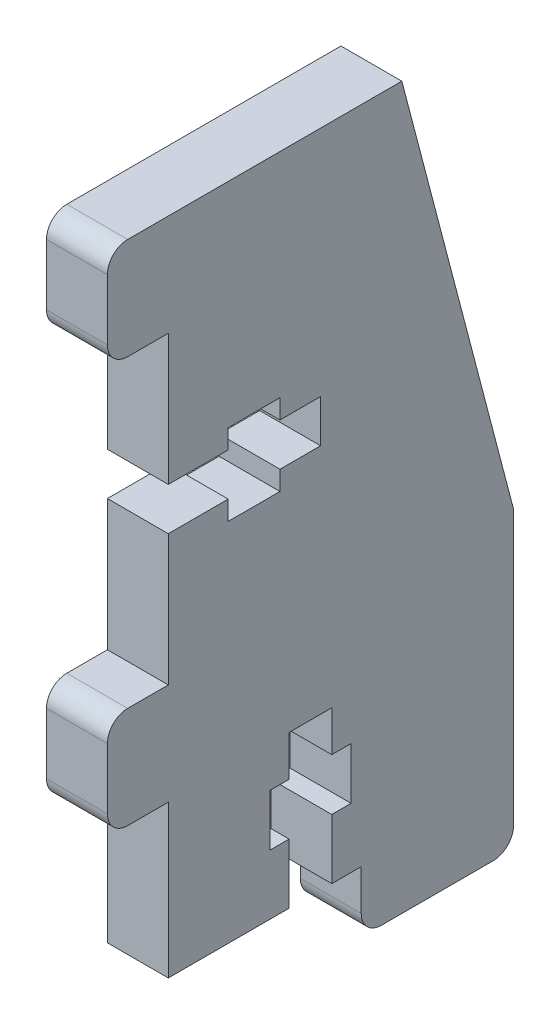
ISO-10303-21;
HEADER;
FILE_DESCRIPTION(('STEP AP214'),'2;1');
FILE_NAME('part.step','',(''),(''),'','','');
FILE_SCHEMA(('AUTOMOTIVE_DESIGN { 1 0 10303 214 1 1 1 1 }'));
ENDSEC;
DATA;
#1=APPLICATION_CONTEXT('core data for automotive mechanical design processes');
#2=APPLICATION_PROTOCOL_DEFINITION('international standard','automotive_design',2000,#1);
#3=PRODUCT_CONTEXT('',#1,'mechanical');
#4=PRODUCT('Part','Part','',(#3));
#5=PRODUCT_RELATED_PRODUCT_CATEGORY('part','',(#4));
#6=PRODUCT_DEFINITION_FORMATION('','',#4);
#7=PRODUCT_DEFINITION_CONTEXT('part definition',#1,'design');
#8=PRODUCT_DEFINITION('design','',#6,#7);
#9=PRODUCT_DEFINITION_SHAPE('','',#8);
#10=(LENGTH_UNIT() NAMED_UNIT(*) SI_UNIT(.MILLI.,.METRE.));
#11=(NAMED_UNIT(*) PLANE_ANGLE_UNIT() SI_UNIT($,.RADIAN.));
#12=(NAMED_UNIT(*) SI_UNIT($,.STERADIAN.) SOLID_ANGLE_UNIT());
#13=UNCERTAINTY_MEASURE_WITH_UNIT(LENGTH_MEASURE(1.E-05),#10,'distance_accuracy_value','');
#14=(GEOMETRIC_REPRESENTATION_CONTEXT(3) GLOBAL_UNCERTAINTY_ASSIGNED_CONTEXT((#13)) GLOBAL_UNIT_ASSIGNED_CONTEXT((#10,
#11,#12)) REPRESENTATION_CONTEXT('',''));
#15=CARTESIAN_POINT('',(0.,0.,0.));
#16=DIRECTION('',(0.,0.,1.));
#17=DIRECTION('',(1.,0.,0.));
#18=AXIS2_PLACEMENT_3D('',#15,#16,#17);
#19=CARTESIAN_POINT('',(6.,0.,0.));
#20=DIRECTION('',(0.,1.,0.));
#21=DIRECTION('',(0.,0.,1.));
#22=AXIS2_PLACEMENT_3D('',#19,#20,#21);
#23=PLANE('',#22);
#24=DIRECTION('',(1.,0.,0.));
#25=VECTOR('',#24,1.);
#26=CARTESIAN_POINT('',(0.,0.,-11.9));
#27=LINE('',#26,#25);
#28=CARTESIAN_POINT('',(0.,0.,-11.9));
#29=VERTEX_POINT('',#28);
#30=CARTESIAN_POINT('',(6.,0.,-11.9));
#31=VERTEX_POINT('',#30);
#32=EDGE_CURVE('E429',#29,#31,#27,.T.);
#33=ORIENTED_EDGE('',*,*,#32,.T.);
#34=DIRECTION('',(0.,0.,-1.));
#35=VECTOR('',#34,1.);
#36=CARTESIAN_POINT('',(6.,0.,0.));
#37=LINE('',#36,#35);
#38=CARTESIAN_POINT('',(6.,0.,0.));
#39=VERTEX_POINT('',#38);
#40=EDGE_CURVE('E492',#39,#31,#37,.T.);
#41=ORIENTED_EDGE('',*,*,#40,.F.);
#42=DIRECTION('',(-1.,0.,0.));
#43=VECTOR('',#42,1.);
#44=CARTESIAN_POINT('',(6.,0.,0.));
#45=LINE('',#44,#43);
#46=CARTESIAN_POINT('',(0.,0.,0.));
#47=VERTEX_POINT('',#46);
#48=EDGE_CURVE('E567',#39,#47,#45,.T.);
#49=ORIENTED_EDGE('',*,*,#48,.T.);
#50=DIRECTION('',(0.,0.,-1.));
#51=VECTOR('',#50,1.);
#52=CARTESIAN_POINT('',(0.,0.,0.));
#53=LINE('',#52,#51);
#54=EDGE_CURVE('E556',#47,#29,#53,.T.);
#55=ORIENTED_EDGE('',*,*,#54,.T.);
#56=EDGE_LOOP('',(#33,#41,#49,#55));
#57=FACE_BOUND('',#56,.T.);
#58=ADVANCED_FACE('F37',(#57),#23,.F.);
#59=CARTESIAN_POINT('',(6.,65.,0.));
#60=DIRECTION('',(0.,-1.,0.));
#61=DIRECTION('',(0.,0.,-1.));
#62=AXIS2_PLACEMENT_3D('',#59,#60,#61);
#63=PLANE('',#62);
#64=DIRECTION('',(0.,0.,1.));
#65=VECTOR('',#64,1.);
#66=CARTESIAN_POINT('',(0.,65.,0.));
#67=LINE('',#66,#65);
#68=CARTESIAN_POINT('',(0.,65.,-23.));
#69=VERTEX_POINT('',#68);
#70=CARTESIAN_POINT('',(0.,65.,3.99999999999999));
#71=VERTEX_POINT('',#70);
#72=EDGE_CURVE('E416',#69,#71,#67,.T.);
#73=ORIENTED_EDGE('',*,*,#72,.T.);
#74=DIRECTION('',(-1.,0.,0.));
#75=VECTOR('',#74,1.);
#76=CARTESIAN_POINT('',(6.,65.,3.99999999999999));
#77=LINE('',#76,#75);
#78=CARTESIAN_POINT('',(6.,65.,3.99999999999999));
#79=VERTEX_POINT('',#78);
#80=EDGE_CURVE('E11',#79,#71,#77,.T.);
#81=ORIENTED_EDGE('',*,*,#80,.F.);
#82=DIRECTION('',(0.,0.,1.));
#83=VECTOR('',#82,1.);
#84=CARTESIAN_POINT('',(6.,65.,0.));
#85=LINE('',#84,#83);
#86=CARTESIAN_POINT('',(6.,65.,-23.));
#87=VERTEX_POINT('',#86);
#88=EDGE_CURVE('E439',#87,#79,#85,.T.);
#89=ORIENTED_EDGE('',*,*,#88,.F.);
#90=DIRECTION('',(-1.,0.,0.));
#91=VECTOR('',#90,1.);
#92=CARTESIAN_POINT('',(6.,65.,-23.));
#93=LINE('',#92,#91);
#94=EDGE_CURVE('E500',#87,#69,#93,.T.);
#95=ORIENTED_EDGE('',*,*,#94,.T.);
#96=EDGE_LOOP('',(#73,#81,#89,#95));
#97=FACE_BOUND('',#96,.T.);
#98=ADVANCED_FACE('F39',(#97),#63,.F.);
#99=CARTESIAN_POINT('',(6.,63.,4.));
#100=DIRECTION('',(-1.,0.,0.));
#101=DIRECTION('',(0.,0.,1.));
#102=AXIS2_PLACEMENT_3D('',#99,#100,#101);
#103=CYLINDRICAL_SURFACE('',#102,2.);
#104=CARTESIAN_POINT('',(0.,63.,4.));
#105=DIRECTION('',(1.,0.,0.));
#106=DIRECTION('',(0.,0.,-1.));
#107=AXIS2_PLACEMENT_3D('',#104,#105,#106);
#108=CIRCLE('',#107,2.);
#109=CARTESIAN_POINT('',(0.,63.,6.));
#110=VERTEX_POINT('',#109);
#111=EDGE_CURVE('E503',#71,#110,#108,.T.);
#112=ORIENTED_EDGE('',*,*,#111,.T.);
#113=DIRECTION('',(-1.,0.,0.));
#114=VECTOR('',#113,1.);
#115=CARTESIAN_POINT('',(6.,63.,6.));
#116=LINE('',#115,#114);
#117=CARTESIAN_POINT('',(6.,63.,6.));
#118=VERTEX_POINT('',#117);
#119=EDGE_CURVE('E45',#118,#110,#116,.T.);
#120=ORIENTED_EDGE('',*,*,#119,.F.);
#121=CARTESIAN_POINT('',(6.,63.,4.));
#122=DIRECTION('',(1.,0.,0.));
#123=DIRECTION('',(0.,0.,-1.));
#124=AXIS2_PLACEMENT_3D('',#121,#122,#123);
#125=CIRCLE('',#124,2.);
#126=EDGE_CURVE('E442',#79,#118,#125,.T.);
#127=ORIENTED_EDGE('',*,*,#126,.F.);
#128=ORIENTED_EDGE('',*,*,#80,.T.);
#129=EDGE_LOOP('',(#112,#120,#127,#128));
#130=FACE_BOUND('',#129,.T.);
#131=ADVANCED_FACE('F747',(#130),#103,.T.);
#132=CARTESIAN_POINT('',(6.,0.,5.99999999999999));
#133=DIRECTION('',(0.,0.,-1.));
#134=DIRECTION('',(0.,1.,0.));
#135=AXIS2_PLACEMENT_3D('',#132,#133,#134);
#136=PLANE('',#135);
#137=DIRECTION('',(0.,-1.,0.));
#138=VECTOR('',#137,1.);
#139=CARTESIAN_POINT('',(0.,0.,5.99999999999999));
#140=LINE('',#139,#138);
#141=CARTESIAN_POINT('',(0.,57.,6.));
#142=VERTEX_POINT('',#141);
#143=EDGE_CURVE('E505',#110,#142,#140,.T.);
#144=ORIENTED_EDGE('',*,*,#143,.T.);
#145=DIRECTION('',(-1.,0.,0.));
#146=VECTOR('',#145,1.);
#147=CARTESIAN_POINT('',(6.,57.,6.));
#148=LINE('',#147,#146);
#149=CARTESIAN_POINT('',(6.,57.,6.));
#150=VERTEX_POINT('',#149);
#151=EDGE_CURVE('E613',#150,#142,#148,.T.);
#152=ORIENTED_EDGE('',*,*,#151,.F.);
#153=DIRECTION('',(0.,-1.,0.));
#154=VECTOR('',#153,1.);
#155=CARTESIAN_POINT('',(6.,0.,5.99999999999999));
#156=LINE('',#155,#154);
#157=EDGE_CURVE('E445',#118,#150,#156,.T.);
#158=ORIENTED_EDGE('',*,*,#157,.F.);
#159=ORIENTED_EDGE('',*,*,#119,.T.);
#160=EDGE_LOOP('',(#144,#152,#158,#159));
#161=FACE_BOUND('',#160,.T.);
#162=ADVANCED_FACE('F619',(#161),#136,.F.);
#163=CARTESIAN_POINT('',(6.,57.,4.));
#164=DIRECTION('',(-1.,0.,0.));
#165=DIRECTION('',(0.,0.,1.));
#166=AXIS2_PLACEMENT_3D('',#163,#164,#165);
#167=CYLINDRICAL_SURFACE('',#166,2.);
#168=CARTESIAN_POINT('',(0.,57.,4.));
#169=DIRECTION('',(1.,0.,0.));
#170=DIRECTION('',(0.,0.,-1.));
#171=AXIS2_PLACEMENT_3D('',#168,#169,#170);
#172=CIRCLE('',#171,2.);
#173=CARTESIAN_POINT('',(0.,55.,3.99999999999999));
#174=VERTEX_POINT('',#173);
#175=EDGE_CURVE('E508',#174,#142,#172,.F.);
#176=ORIENTED_EDGE('',*,*,#175,.F.);
#177=DIRECTION('',(-1.,0.,0.));
#178=VECTOR('',#177,1.);
#179=CARTESIAN_POINT('',(6.,55.,3.99999999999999));
#180=LINE('',#179,#178);
#181=CARTESIAN_POINT('',(6.,55.,3.99999999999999));
#182=VERTEX_POINT('',#181);
#183=EDGE_CURVE('E611',#182,#174,#180,.T.);
#184=ORIENTED_EDGE('',*,*,#183,.F.);
#185=CARTESIAN_POINT('',(6.,57.,4.));
#186=DIRECTION('',(1.,0.,0.));
#187=DIRECTION('',(0.,0.,-1.));
#188=AXIS2_PLACEMENT_3D('',#185,#186,#187);
#189=CIRCLE('',#188,2.);
#190=EDGE_CURVE('E447',#182,#150,#189,.F.);
#191=ORIENTED_EDGE('',*,*,#190,.T.);
#192=ORIENTED_EDGE('',*,*,#151,.T.);
#193=EDGE_LOOP('',(#176,#184,#191,#192));
#194=FACE_BOUND('',#193,.T.);
#195=ADVANCED_FACE('F628',(#194),#167,.T.);
#196=CARTESIAN_POINT('',(6.,55.,0.));
#197=DIRECTION('',(0.,-1.,0.));
#198=DIRECTION('',(0.,0.,-1.));
#199=AXIS2_PLACEMENT_3D('',#196,#197,#198);
#200=PLANE('',#199);
#201=DIRECTION('',(0.,0.,1.));
#202=VECTOR('',#201,1.);
#203=CARTESIAN_POINT('',(0.,55.,0.));
#204=LINE('',#203,#202);
#205=CARTESIAN_POINT('',(0.,55.,0.));
#206=VERTEX_POINT('',#205);
#207=EDGE_CURVE('E511',#206,#174,#204,.T.);
#208=ORIENTED_EDGE('',*,*,#207,.F.);
#209=DIRECTION('',(-1.,0.,0.));
#210=VECTOR('',#209,1.);
#211=CARTESIAN_POINT('',(6.,55.,0.));
#212=LINE('',#211,#210);
#213=CARTESIAN_POINT('',(6.,55.,0.));
#214=VERTEX_POINT('',#213);
#215=EDGE_CURVE('E609',#214,#206,#212,.T.);
#216=ORIENTED_EDGE('',*,*,#215,.F.);
#217=DIRECTION('',(0.,0.,1.));
#218=VECTOR('',#217,1.);
#219=CARTESIAN_POINT('',(6.,55.,0.));
#220=LINE('',#219,#218);
#221=EDGE_CURVE('E450',#214,#182,#220,.T.);
#222=ORIENTED_EDGE('',*,*,#221,.T.);
#223=ORIENTED_EDGE('',*,*,#183,.T.);
#224=EDGE_LOOP('',(#208,#216,#222,#223));
#225=FACE_BOUND('',#224,.T.);
#226=ADVANCED_FACE('F633',(#225),#200,.T.);
#227=CARTESIAN_POINT('',(6.,0.,0.));
#228=DIRECTION('',(0.,0.,1.));
#229=DIRECTION('',(1.,0.,0.));
#230=AXIS2_PLACEMENT_3D('',#227,#228,#229);
#231=PLANE('',#230);
#232=DIRECTION('',(0.,1.,0.));
#233=VECTOR('',#232,1.);
#234=CARTESIAN_POINT('',(0.,0.,0.));
#235=LINE('',#234,#233);
#236=CARTESIAN_POINT('',(0.,42.1,0.));
#237=VERTEX_POINT('',#236);
#238=EDGE_CURVE('E514',#237,#206,#235,.T.);
#239=ORIENTED_EDGE('',*,*,#238,.F.);
#240=DIRECTION('',(-1.,0.,0.));
#241=VECTOR('',#240,1.);
#242=CARTESIAN_POINT('',(6.,42.1,0.));
#243=LINE('',#242,#241);
#244=CARTESIAN_POINT('',(6.,42.1,0.));
#245=VERTEX_POINT('',#244);
#246=EDGE_CURVE('E607',#245,#237,#243,.T.);
#247=ORIENTED_EDGE('',*,*,#246,.F.);
#248=DIRECTION('',(0.,1.,0.));
#249=VECTOR('',#248,1.);
#250=CARTESIAN_POINT('',(6.,0.,0.));
#251=LINE('',#250,#249);
#252=EDGE_CURVE('E453',#245,#214,#251,.T.);
#253=ORIENTED_EDGE('',*,*,#252,.T.);
#254=ORIENTED_EDGE('',*,*,#215,.T.);
#255=EDGE_LOOP('',(#239,#247,#253,#254));
#256=FACE_BOUND('',#255,.T.);
#257=ADVANCED_FACE('F636',(#256),#231,.T.);
#258=CARTESIAN_POINT('',(6.,42.1,0.));
#259=DIRECTION('',(0.,1.,0.));
#260=DIRECTION('',(0.,0.,1.));
#261=AXIS2_PLACEMENT_3D('',#258,#259,#260);
#262=PLANE('',#261);
#263=DIRECTION('',(0.,0.,-1.));
#264=VECTOR('',#263,1.);
#265=CARTESIAN_POINT('',(0.,42.1,0.));
#266=LINE('',#265,#264);
#267=CARTESIAN_POINT('',(0.,42.1,-5.9));
#268=VERTEX_POINT('',#267);
#269=EDGE_CURVE('E517',#237,#268,#266,.T.);
#270=ORIENTED_EDGE('',*,*,#269,.T.);
#271=DIRECTION('',(-1.,0.,0.));
#272=VECTOR('',#271,1.);
#273=CARTESIAN_POINT('',(6.,42.1,-5.9));
#274=LINE('',#273,#272);
#275=CARTESIAN_POINT('',(6.,42.1,-5.9));
#276=VERTEX_POINT('',#275);
#277=EDGE_CURVE('E605',#276,#268,#274,.T.);
#278=ORIENTED_EDGE('',*,*,#277,.F.);
#279=DIRECTION('',(0.,0.,-1.));
#280=VECTOR('',#279,1.);
#281=CARTESIAN_POINT('',(6.,42.1,0.));
#282=LINE('',#281,#280);
#283=EDGE_CURVE('E456',#245,#276,#282,.T.);
#284=ORIENTED_EDGE('',*,*,#283,.F.);
#285=ORIENTED_EDGE('',*,*,#246,.T.);
#286=EDGE_LOOP('',(#270,#278,#284,#285));
#287=FACE_BOUND('',#286,.T.);
#288=ADVANCED_FACE('F641',(#287),#262,.F.);
#289=CARTESIAN_POINT('',(6.,0.,-5.9));
#290=DIRECTION('',(0.,0.,-1.));
#291=DIRECTION('',(-1.,0.,0.));
#292=AXIS2_PLACEMENT_3D('',#289,#290,#291);
#293=PLANE('',#292);
#294=DIRECTION('',(0.,-1.,0.));
#295=VECTOR('',#294,1.);
#296=CARTESIAN_POINT('',(0.,0.,-5.9));
#297=LINE('',#296,#295);
#298=CARTESIAN_POINT('',(0.,44.,-5.9));
#299=VERTEX_POINT('',#298);
#300=EDGE_CURVE('E522',#299,#268,#297,.T.);
#301=ORIENTED_EDGE('',*,*,#300,.F.);
#302=DIRECTION('',(-1.,0.,0.));
#303=VECTOR('',#302,1.);
#304=CARTESIAN_POINT('',(6.,44.,-5.9));
#305=LINE('',#304,#303);
#306=CARTESIAN_POINT('',(6.,44.,-5.9));
#307=VERTEX_POINT('',#306);
#308=EDGE_CURVE('E603',#307,#299,#305,.T.);
#309=ORIENTED_EDGE('',*,*,#308,.F.);
#310=DIRECTION('',(0.,-1.,0.));
#311=VECTOR('',#310,1.);
#312=CARTESIAN_POINT('',(6.,0.,-5.9));
#313=LINE('',#312,#311);
#314=EDGE_CURVE('E460',#307,#276,#313,.T.);
#315=ORIENTED_EDGE('',*,*,#314,.T.);
#316=ORIENTED_EDGE('',*,*,#277,.T.);
#317=EDGE_LOOP('',(#301,#309,#315,#316));
#318=FACE_BOUND('',#317,.T.);
#319=ADVANCED_FACE('F645',(#318),#293,.T.);
#320=CARTESIAN_POINT('',(6.,44.,0.));
#321=DIRECTION('',(0.,1.,0.));
#322=DIRECTION('',(0.,0.,1.));
#323=AXIS2_PLACEMENT_3D('',#320,#321,#322);
#324=PLANE('',#323);
#325=DIRECTION('',(0.,0.,-1.));
#326=VECTOR('',#325,1.);
#327=CARTESIAN_POINT('',(0.,44.,0.));
#328=LINE('',#327,#326);
#329=CARTESIAN_POINT('',(0.,44.,-11.));
#330=VERTEX_POINT('',#329);
#331=EDGE_CURVE('E526',#299,#330,#328,.T.);
#332=ORIENTED_EDGE('',*,*,#331,.T.);
#333=DIRECTION('',(-1.,0.,0.));
#334=VECTOR('',#333,1.);
#335=CARTESIAN_POINT('',(6.,44.,-11.));
#336=LINE('',#335,#334);
#337=CARTESIAN_POINT('',(6.,44.,-11.));
#338=VERTEX_POINT('',#337);
#339=EDGE_CURVE('E600',#338,#330,#336,.T.);
#340=ORIENTED_EDGE('',*,*,#339,.F.);
#341=DIRECTION('',(0.,0.,-1.));
#342=VECTOR('',#341,1.);
#343=CARTESIAN_POINT('',(6.,44.,0.));
#344=LINE('',#343,#342);
#345=EDGE_CURVE('E464',#307,#338,#344,.T.);
#346=ORIENTED_EDGE('',*,*,#345,.F.);
#347=ORIENTED_EDGE('',*,*,#308,.T.);
#348=EDGE_LOOP('',(#332,#340,#346,#347));
#349=FACE_BOUND('',#348,.T.);
#350=ADVANCED_FACE('F650',(#349),#324,.F.);
#351=CARTESIAN_POINT('',(6.,0.,-11.));
#352=DIRECTION('',(0.,0.,-1.));
#353=DIRECTION('',(-1.,0.,0.));
#354=AXIS2_PLACEMENT_3D('',#351,#352,#353);
#355=PLANE('',#354);
#356=DIRECTION('',(0.,-1.,0.));
#357=VECTOR('',#356,1.);
#358=CARTESIAN_POINT('',(0.,0.,-11.));
#359=LINE('',#358,#357);
#360=CARTESIAN_POINT('',(0.,42.1,-11.));
#361=VERTEX_POINT('',#360);
#362=EDGE_CURVE('E529',#330,#361,#359,.T.);
#363=ORIENTED_EDGE('',*,*,#362,.T.);
#364=DIRECTION('',(-1.,0.,0.));
#365=VECTOR('',#364,1.);
#366=CARTESIAN_POINT('',(6.,42.1,-11.));
#367=LINE('',#366,#365);
#368=CARTESIAN_POINT('',(6.,42.1,-11.));
#369=VERTEX_POINT('',#368);
#370=EDGE_CURVE('E597',#369,#361,#367,.T.);
#371=ORIENTED_EDGE('',*,*,#370,.F.);
#372=DIRECTION('',(0.,-1.,0.));
#373=VECTOR('',#372,1.);
#374=CARTESIAN_POINT('',(6.,0.,-11.));
#375=LINE('',#374,#373);
#376=EDGE_CURVE('E467',#338,#369,#375,.T.);
#377=ORIENTED_EDGE('',*,*,#376,.F.);
#378=ORIENTED_EDGE('',*,*,#339,.T.);
#379=EDGE_LOOP('',(#363,#371,#377,#378));
#380=FACE_BOUND('',#379,.T.);
#381=ADVANCED_FACE('F656',(#380),#355,.F.);
#382=CARTESIAN_POINT('',(0.,42.1,-15.));
#383=VERTEX_POINT('',#382);
#384=EDGE_CURVE('E523',#361,#383,#266,.T.);
#385=ORIENTED_EDGE('',*,*,#384,.T.);
#386=DIRECTION('',(-1.,0.,0.));
#387=VECTOR('',#386,1.);
#388=CARTESIAN_POINT('',(6.,42.1,-15.));
#389=LINE('',#388,#387);
#390=CARTESIAN_POINT('',(6.,42.1,-15.));
#391=VERTEX_POINT('',#390);
#392=EDGE_CURVE('E594',#391,#383,#389,.T.);
#393=ORIENTED_EDGE('',*,*,#392,.F.);
#394=EDGE_CURVE('E461',#369,#391,#282,.T.);
#395=ORIENTED_EDGE('',*,*,#394,.F.);
#396=ORIENTED_EDGE('',*,*,#370,.T.);
#397=EDGE_LOOP('',(#385,#393,#395,#396));
#398=FACE_BOUND('',#397,.T.);
#399=ADVANCED_FACE('F660',(#398),#262,.F.);
#400=CARTESIAN_POINT('',(6.,0.,-15.));
#401=DIRECTION('',(0.,0.,-1.));
#402=DIRECTION('',(-1.,0.,0.));
#403=AXIS2_PLACEMENT_3D('',#400,#401,#402);
#404=PLANE('',#403);
#405=DIRECTION('',(0.,-1.,0.));
#406=VECTOR('',#405,1.);
#407=CARTESIAN_POINT('',(0.,0.,-15.));
#408=LINE('',#407,#406);
#409=CARTESIAN_POINT('',(0.,37.9,-15.));
#410=VERTEX_POINT('',#409);
#411=EDGE_CURVE('E532',#383,#410,#408,.T.);
#412=ORIENTED_EDGE('',*,*,#411,.T.);
#413=DIRECTION('',(-1.,0.,0.));
#414=VECTOR('',#413,1.);
#415=CARTESIAN_POINT('',(6.,37.9,-15.));
#416=LINE('',#415,#414);
#417=CARTESIAN_POINT('',(6.,37.9,-15.));
#418=VERTEX_POINT('',#417);
#419=EDGE_CURVE('E592',#418,#410,#416,.T.);
#420=ORIENTED_EDGE('',*,*,#419,.F.);
#421=DIRECTION('',(0.,-1.,0.));
#422=VECTOR('',#421,1.);
#423=CARTESIAN_POINT('',(6.,0.,-15.));
#424=LINE('',#423,#422);
#425=EDGE_CURVE('E470',#391,#418,#424,.T.);
#426=ORIENTED_EDGE('',*,*,#425,.F.);
#427=ORIENTED_EDGE('',*,*,#392,.T.);
#428=EDGE_LOOP('',(#412,#420,#426,#427));
#429=FACE_BOUND('',#428,.T.);
#430=ADVANCED_FACE('F665',(#429),#404,.F.);
#431=CARTESIAN_POINT('',(6.,37.9,0.));
#432=DIRECTION('',(0.,1.,0.));
#433=DIRECTION('',(0.,0.,1.));
#434=AXIS2_PLACEMENT_3D('',#431,#432,#433);
#435=PLANE('',#434);
#436=DIRECTION('',(0.,0.,-1.));
#437=VECTOR('',#436,1.);
#438=CARTESIAN_POINT('',(0.,37.9,0.));
#439=LINE('',#438,#437);
#440=CARTESIAN_POINT('',(0.,37.9,-11.));
#441=VERTEX_POINT('',#440);
#442=EDGE_CURVE('E535',#441,#410,#439,.T.);
#443=ORIENTED_EDGE('',*,*,#442,.F.);
#444=DIRECTION('',(-1.,0.,0.));
#445=VECTOR('',#444,1.);
#446=CARTESIAN_POINT('',(6.,37.9,-11.));
#447=LINE('',#446,#445);
#448=CARTESIAN_POINT('',(6.,37.9,-11.));
#449=VERTEX_POINT('',#448);
#450=EDGE_CURVE('E590',#449,#441,#447,.T.);
#451=ORIENTED_EDGE('',*,*,#450,.F.);
#452=DIRECTION('',(0.,0.,-1.));
#453=VECTOR('',#452,1.);
#454=CARTESIAN_POINT('',(6.,37.9,0.));
#455=LINE('',#454,#453);
#456=EDGE_CURVE('E472',#449,#418,#455,.T.);
#457=ORIENTED_EDGE('',*,*,#456,.T.);
#458=ORIENTED_EDGE('',*,*,#419,.T.);
#459=EDGE_LOOP('',(#443,#451,#457,#458));
#460=FACE_BOUND('',#459,.T.);
#461=ADVANCED_FACE('F672',(#460),#435,.T.);
#462=CARTESIAN_POINT('',(0.,36.,-11.));
#463=VERTEX_POINT('',#462);
#464=EDGE_CURVE('E531',#441,#463,#359,.T.);
#465=ORIENTED_EDGE('',*,*,#464,.T.);
#466=DIRECTION('',(-1.,0.,0.));
#467=VECTOR('',#466,1.);
#468=CARTESIAN_POINT('',(6.,36.,-11.));
#469=LINE('',#468,#467);
#470=CARTESIAN_POINT('',(6.,36.,-11.));
#471=VERTEX_POINT('',#470);
#472=EDGE_CURVE('E588',#471,#463,#469,.T.);
#473=ORIENTED_EDGE('',*,*,#472,.F.);
#474=EDGE_CURVE('E469',#449,#471,#375,.T.);
#475=ORIENTED_EDGE('',*,*,#474,.F.);
#476=ORIENTED_EDGE('',*,*,#450,.T.);
#477=EDGE_LOOP('',(#465,#473,#475,#476));
#478=FACE_BOUND('',#477,.T.);
#479=ADVANCED_FACE('F676',(#478),#355,.F.);
#480=CARTESIAN_POINT('',(6.,36.,0.));
#481=DIRECTION('',(0.,1.,0.));
#482=DIRECTION('',(0.,0.,1.));
#483=AXIS2_PLACEMENT_3D('',#480,#481,#482);
#484=PLANE('',#483);
#485=DIRECTION('',(0.,0.,-1.));
#486=VECTOR('',#485,1.);
#487=CARTESIAN_POINT('',(0.,36.,0.));
#488=LINE('',#487,#486);
#489=CARTESIAN_POINT('',(0.,36.,-5.9));
#490=VERTEX_POINT('',#489);
#491=EDGE_CURVE('E539',#490,#463,#488,.T.);
#492=ORIENTED_EDGE('',*,*,#491,.F.);
#493=DIRECTION('',(-1.,0.,0.));
#494=VECTOR('',#493,1.);
#495=CARTESIAN_POINT('',(6.,36.,-5.9));
#496=LINE('',#495,#494);
#497=CARTESIAN_POINT('',(6.,36.,-5.9));
#498=VERTEX_POINT('',#497);
#499=EDGE_CURVE('E586',#498,#490,#496,.T.);
#500=ORIENTED_EDGE('',*,*,#499,.F.);
#501=DIRECTION('',(0.,0.,-1.));
#502=VECTOR('',#501,1.);
#503=CARTESIAN_POINT('',(6.,36.,0.));
#504=LINE('',#503,#502);
#505=EDGE_CURVE('E476',#498,#471,#504,.T.);
#506=ORIENTED_EDGE('',*,*,#505,.T.);
#507=ORIENTED_EDGE('',*,*,#472,.T.);
#508=EDGE_LOOP('',(#492,#500,#506,#507));
#509=FACE_BOUND('',#508,.T.);
#510=ADVANCED_FACE('F679',(#509),#484,.T.);
#511=CARTESIAN_POINT('',(0.,37.9,-5.9));
#512=VERTEX_POINT('',#511);
#513=EDGE_CURVE('E527',#512,#490,#297,.T.);
#514=ORIENTED_EDGE('',*,*,#513,.F.);
#515=DIRECTION('',(-1.,0.,0.));
#516=VECTOR('',#515,1.);
#517=CARTESIAN_POINT('',(6.,37.9,-5.9));
#518=LINE('',#517,#516);
#519=CARTESIAN_POINT('',(6.,37.9,-5.9));
#520=VERTEX_POINT('',#519);
#521=EDGE_CURVE('E584',#520,#512,#518,.T.);
#522=ORIENTED_EDGE('',*,*,#521,.F.);
#523=EDGE_CURVE('E465',#520,#498,#313,.T.);
#524=ORIENTED_EDGE('',*,*,#523,.T.);
#525=ORIENTED_EDGE('',*,*,#499,.T.);
#526=EDGE_LOOP('',(#514,#522,#524,#525));
#527=FACE_BOUND('',#526,.T.);
#528=ADVANCED_FACE('F686',(#527),#293,.T.);
#529=CARTESIAN_POINT('',(0.,37.9,0.));
#530=VERTEX_POINT('',#529);
#531=EDGE_CURVE('E538',#530,#512,#439,.T.);
#532=ORIENTED_EDGE('',*,*,#531,.F.);
#533=DIRECTION('',(-1.,0.,0.));
#534=VECTOR('',#533,1.);
#535=CARTESIAN_POINT('',(6.,37.9,0.));
#536=LINE('',#535,#534);
#537=CARTESIAN_POINT('',(6.,37.9,0.));
#538=VERTEX_POINT('',#537);
#539=EDGE_CURVE('E582',#538,#530,#536,.T.);
#540=ORIENTED_EDGE('',*,*,#539,.F.);
#541=EDGE_CURVE('E475',#538,#520,#455,.T.);
#542=ORIENTED_EDGE('',*,*,#541,.T.);
#543=ORIENTED_EDGE('',*,*,#521,.T.);
#544=EDGE_LOOP('',(#532,#540,#542,#543));
#545=FACE_BOUND('',#544,.T.);
#546=ADVANCED_FACE('F713',(#545),#435,.T.);
#547=CARTESIAN_POINT('',(0.,25.,0.));
#548=VERTEX_POINT('',#547);
#549=EDGE_CURVE('E519',#548,#530,#235,.T.);
#550=ORIENTED_EDGE('',*,*,#549,.F.);
#551=DIRECTION('',(-1.,0.,0.));
#552=VECTOR('',#551,1.);
#553=CARTESIAN_POINT('',(6.,25.,0.));
#554=LINE('',#553,#552);
#555=CARTESIAN_POINT('',(6.,25.,0.));
#556=VERTEX_POINT('',#555);
#557=EDGE_CURVE('E580',#556,#548,#554,.T.);
#558=ORIENTED_EDGE('',*,*,#557,.F.);
#559=EDGE_CURVE('E458',#556,#538,#251,.T.);
#560=ORIENTED_EDGE('',*,*,#559,.T.);
#561=ORIENTED_EDGE('',*,*,#539,.T.);
#562=EDGE_LOOP('',(#550,#558,#560,#561));
#563=FACE_BOUND('',#562,.T.);
#564=ADVANCED_FACE('F728',(#563),#231,.T.);
#565=CARTESIAN_POINT('',(6.,25.,0.));
#566=DIRECTION('',(0.,-1.,0.));
#567=DIRECTION('',(0.,0.,-1.));
#568=AXIS2_PLACEMENT_3D('',#565,#566,#567);
#569=PLANE('',#568);
#570=DIRECTION('',(0.,0.,1.));
#571=VECTOR('',#570,1.);
#572=CARTESIAN_POINT('',(0.,25.,0.));
#573=LINE('',#572,#571);
#574=CARTESIAN_POINT('',(0.,25.,4.));
#575=VERTEX_POINT('',#574);
#576=EDGE_CURVE('E542',#548,#575,#573,.T.);
#577=ORIENTED_EDGE('',*,*,#576,.T.);
#578=DIRECTION('',(-1.,0.,0.));
#579=VECTOR('',#578,1.);
#580=CARTESIAN_POINT('',(6.,25.,4.));
#581=LINE('',#580,#579);
#582=CARTESIAN_POINT('',(6.,25.,4.));
#583=VERTEX_POINT('',#582);
#584=EDGE_CURVE('E577',#583,#575,#581,.T.);
#585=ORIENTED_EDGE('',*,*,#584,.F.);
#586=DIRECTION('',(0.,0.,1.));
#587=VECTOR('',#586,1.);
#588=CARTESIAN_POINT('',(6.,25.,0.));
#589=LINE('',#588,#587);
#590=EDGE_CURVE('E479',#556,#583,#589,.T.);
#591=ORIENTED_EDGE('',*,*,#590,.F.);
#592=ORIENTED_EDGE('',*,*,#557,.T.);
#593=EDGE_LOOP('',(#577,#585,#591,#592));
#594=FACE_BOUND('',#593,.T.);
#595=ADVANCED_FACE('F719',(#594),#569,.F.);
#596=CARTESIAN_POINT('',(6.,23.,4.));
#597=DIRECTION('',(-1.,0.,0.));
#598=DIRECTION('',(0.,0.,1.));
#599=AXIS2_PLACEMENT_3D('',#596,#597,#598);
#600=CYLINDRICAL_SURFACE('',#599,2.);
#601=CARTESIAN_POINT('',(0.,23.,4.));
#602=DIRECTION('',(1.,0.,0.));
#603=DIRECTION('',(0.,0.,-1.));
#604=AXIS2_PLACEMENT_3D('',#601,#602,#603);
#605=CIRCLE('',#604,2.);
#606=CARTESIAN_POINT('',(0.,23.,6.));
#607=VERTEX_POINT('',#606);
#608=EDGE_CURVE('E544',#575,#607,#605,.T.);
#609=ORIENTED_EDGE('',*,*,#608,.T.);
#610=DIRECTION('',(-1.,0.,0.));
#611=VECTOR('',#610,1.);
#612=CARTESIAN_POINT('',(6.,23.,6.));
#613=LINE('',#612,#611);
#614=CARTESIAN_POINT('',(6.,23.,6.));
#615=VERTEX_POINT('',#614);
#616=EDGE_CURVE('E575',#615,#607,#613,.T.);
#617=ORIENTED_EDGE('',*,*,#616,.F.);
#618=CARTESIAN_POINT('',(6.,23.,4.));
#619=DIRECTION('',(1.,0.,0.));
#620=DIRECTION('',(0.,0.,-1.));
#621=AXIS2_PLACEMENT_3D('',#618,#619,#620);
#622=CIRCLE('',#621,2.);
#623=EDGE_CURVE('E481',#583,#615,#622,.T.);
#624=ORIENTED_EDGE('',*,*,#623,.F.);
#625=ORIENTED_EDGE('',*,*,#584,.T.);
#626=EDGE_LOOP('',(#609,#617,#624,#625));
#627=FACE_BOUND('',#626,.T.);
#628=ADVANCED_FACE('F722',(#627),#600,.T.);
#629=CARTESIAN_POINT('',(6.,0.,6.));
#630=DIRECTION('',(0.,0.,1.));
#631=DIRECTION('',(1.,0.,0.));
#632=AXIS2_PLACEMENT_3D('',#629,#630,#631);
#633=PLANE('',#632);
#634=DIRECTION('',(0.,1.,0.));
#635=VECTOR('',#634,1.);
#636=CARTESIAN_POINT('',(0.,0.,6.));
#637=LINE('',#636,#635);
#638=CARTESIAN_POINT('',(0.,17.,6.));
#639=VERTEX_POINT('',#638);
#640=EDGE_CURVE('E547',#639,#607,#637,.T.);
#641=ORIENTED_EDGE('',*,*,#640,.F.);
#642=DIRECTION('',(-1.,0.,0.));
#643=VECTOR('',#642,1.);
#644=CARTESIAN_POINT('',(6.,17.,6.));
#645=LINE('',#644,#643);
#646=CARTESIAN_POINT('',(6.,17.,6.));
#647=VERTEX_POINT('',#646);
#648=EDGE_CURVE('E573',#647,#639,#645,.T.);
#649=ORIENTED_EDGE('',*,*,#648,.F.);
#650=DIRECTION('',(0.,1.,0.));
#651=VECTOR('',#650,1.);
#652=CARTESIAN_POINT('',(6.,0.,6.));
#653=LINE('',#652,#651);
#654=EDGE_CURVE('E483',#647,#615,#653,.T.);
#655=ORIENTED_EDGE('',*,*,#654,.T.);
#656=ORIENTED_EDGE('',*,*,#616,.T.);
#657=EDGE_LOOP('',(#641,#649,#655,#656));
#658=FACE_BOUND('',#657,.T.);
#659=ADVANCED_FACE('F725',(#658),#633,.T.);
#660=CARTESIAN_POINT('',(6.,17.,4.));
#661=DIRECTION('',(-1.,0.,0.));
#662=DIRECTION('',(0.,0.,1.));
#663=AXIS2_PLACEMENT_3D('',#660,#661,#662);
#664=CYLINDRICAL_SURFACE('',#663,2.);
#665=CARTESIAN_POINT('',(0.,17.,4.));
#666=DIRECTION('',(1.,0.,0.));
#667=DIRECTION('',(0.,0.,-1.));
#668=AXIS2_PLACEMENT_3D('',#665,#666,#667);
#669=CIRCLE('',#668,2.);
#670=CARTESIAN_POINT('',(0.,15.,4.));
#671=VERTEX_POINT('',#670);
#672=EDGE_CURVE('E550',#671,#639,#669,.F.);
#673=ORIENTED_EDGE('',*,*,#672,.F.);
#674=DIRECTION('',(-1.,0.,0.));
#675=VECTOR('',#674,1.);
#676=CARTESIAN_POINT('',(6.,15.,4.));
#677=LINE('',#676,#675);
#678=CARTESIAN_POINT('',(6.,15.,4.));
#679=VERTEX_POINT('',#678);
#680=EDGE_CURVE('E571',#679,#671,#677,.T.);
#681=ORIENTED_EDGE('',*,*,#680,.F.);
#682=CARTESIAN_POINT('',(6.,17.,4.));
#683=DIRECTION('',(1.,0.,0.));
#684=DIRECTION('',(0.,0.,-1.));
#685=AXIS2_PLACEMENT_3D('',#682,#683,#684);
#686=CIRCLE('',#685,2.);
#687=EDGE_CURVE('E486',#679,#647,#686,.F.);
#688=ORIENTED_EDGE('',*,*,#687,.T.);
#689=ORIENTED_EDGE('',*,*,#648,.T.);
#690=EDGE_LOOP('',(#673,#681,#688,#689));
#691=FACE_BOUND('',#690,.T.);
#692=ADVANCED_FACE('F727',(#691),#664,.T.);
#693=CARTESIAN_POINT('',(6.,15.,0.));
#694=DIRECTION('',(0.,-1.,0.));
#695=DIRECTION('',(0.,0.,-1.));
#696=AXIS2_PLACEMENT_3D('',#693,#694,#695);
#697=PLANE('',#696);
#698=DIRECTION('',(0.,0.,1.));
#699=VECTOR('',#698,1.);
#700=CARTESIAN_POINT('',(0.,15.,0.));
#701=LINE('',#700,#699);
#702=CARTESIAN_POINT('',(0.,15.,0.));
#703=VERTEX_POINT('',#702);
#704=EDGE_CURVE('E553',#703,#671,#701,.T.);
#705=ORIENTED_EDGE('',*,*,#704,.F.);
#706=DIRECTION('',(-1.,0.,0.));
#707=VECTOR('',#706,1.);
#708=CARTESIAN_POINT('',(6.,15.,0.));
#709=LINE('',#708,#707);
#710=CARTESIAN_POINT('',(6.,15.,0.));
#711=VERTEX_POINT('',#710);
#712=EDGE_CURVE('E569',#711,#703,#709,.T.);
#713=ORIENTED_EDGE('',*,*,#712,.F.);
#714=DIRECTION('',(0.,0.,1.));
#715=VECTOR('',#714,1.);
#716=CARTESIAN_POINT('',(6.,15.,0.));
#717=LINE('',#716,#715);
#718=EDGE_CURVE('E489',#711,#679,#717,.T.);
#719=ORIENTED_EDGE('',*,*,#718,.T.);
#720=ORIENTED_EDGE('',*,*,#680,.T.);
#721=EDGE_LOOP('',(#705,#713,#719,#720));
#722=FACE_BOUND('',#721,.T.);
#723=ADVANCED_FACE('F702',(#722),#697,.T.);
#724=EDGE_CURVE('E518',#47,#703,#235,.T.);
#725=ORIENTED_EDGE('',*,*,#724,.F.);
#726=ORIENTED_EDGE('',*,*,#48,.F.);
#727=EDGE_CURVE('E457',#39,#711,#251,.T.);
#728=ORIENTED_EDGE('',*,*,#727,.T.);
#729=ORIENTED_EDGE('',*,*,#712,.T.);
#730=EDGE_LOOP('',(#725,#726,#728,#729));
#731=FACE_BOUND('',#730,.T.);
#732=ADVANCED_FACE('F695',(#731),#231,.T.);
#733=CARTESIAN_POINT('',(0.,0.,-16.1));
#734=VERTEX_POINT('',#733);
#735=CARTESIAN_POINT('',(0.,0.,-19.));
#736=VERTEX_POINT('',#735);
#737=EDGE_CURVE('E57',#734,#736,#53,.T.);
#738=ORIENTED_EDGE('',*,*,#737,.T.);
#739=DIRECTION('',(1.,0.,0.));
#740=VECTOR('',#739,1.);
#741=CARTESIAN_POINT('',(-16.1554944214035,0.,-19.));
#742=LINE('',#741,#740);
#743=CARTESIAN_POINT('',(6.,0.,-19.));
#744=VERTEX_POINT('',#743);
#745=EDGE_CURVE('E52',#736,#744,#742,.T.);
#746=ORIENTED_EDGE('',*,*,#745,.T.);
#747=CARTESIAN_POINT('',(6.,0.,-16.1));
#748=VERTEX_POINT('',#747);
#749=EDGE_CURVE('E335',#748,#744,#37,.T.);
#750=ORIENTED_EDGE('',*,*,#749,.F.);
#751=DIRECTION('',(1.,0.,0.));
#752=VECTOR('',#751,1.);
#753=CARTESIAN_POINT('',(0.,0.,-16.1));
#754=LINE('',#753,#752);
#755=EDGE_CURVE('E427',#734,#748,#754,.T.);
#756=ORIENTED_EDGE('',*,*,#755,.F.);
#757=EDGE_LOOP('',(#738,#746,#750,#756));
#758=FACE_BOUND('',#757,.T.);
#759=ADVANCED_FACE('F740',(#758),#23,.F.);
#760=CARTESIAN_POINT('',(6.,0.,-34.));
#761=DIRECTION('',(0.,0.,1.));
#762=DIRECTION('',(1.,0.,0.));
#763=AXIS2_PLACEMENT_3D('',#760,#761,#762);
#764=PLANE('',#763);
#765=DIRECTION('',(0.,1.,0.));
#766=VECTOR('',#765,1.);
#767=CARTESIAN_POINT('',(0.,0.,-34.));
#768=LINE('',#767,#766);
#769=CARTESIAN_POINT('',(0.,-4.,-34.));
#770=VERTEX_POINT('',#769);
#771=CARTESIAN_POINT('',(0.,23.,-34.));
#772=VERTEX_POINT('',#771);
#773=EDGE_CURVE('E559',#770,#772,#768,.T.);
#774=ORIENTED_EDGE('',*,*,#773,.T.);
#775=DIRECTION('',(-1.,0.,0.));
#776=VECTOR('',#775,1.);
#777=CARTESIAN_POINT('',(6.,23.,-34.));
#778=LINE('',#777,#776);
#779=CARTESIAN_POINT('',(6.,23.,-34.));
#780=VERTEX_POINT('',#779);
#781=EDGE_CURVE('E565',#780,#772,#778,.T.);
#782=ORIENTED_EDGE('',*,*,#781,.F.);
#783=DIRECTION('',(0.,1.,0.));
#784=VECTOR('',#783,1.);
#785=CARTESIAN_POINT('',(6.,0.,-34.));
#786=LINE('',#785,#784);
#787=CARTESIAN_POINT('',(6.,-3.99999999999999,-34.));
#788=VERTEX_POINT('',#787);
#789=EDGE_CURVE('E495',#788,#780,#786,.T.);
#790=ORIENTED_EDGE('',*,*,#789,.F.);
#791=DIRECTION('',(1.,0.,0.));
#792=VECTOR('',#791,1.);
#793=CARTESIAN_POINT('',(-16.1554944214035,-3.99999999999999,-34.));
#794=LINE('',#793,#792);
#795=EDGE_CURVE('E345',#770,#788,#794,.T.);
#796=ORIENTED_EDGE('',*,*,#795,.F.);
#797=EDGE_LOOP('',(#774,#782,#790,#796));
#798=FACE_BOUND('',#797,.T.);
#799=ADVANCED_FACE('F751',(#798),#764,.F.);
#800=CARTESIAN_POINT('',(6.,9.80954907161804,-37.4546419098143));
#801=DIRECTION('',(0.,0.253359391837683,-0.967372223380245));
#802=DIRECTION('',(0.,0.967372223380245,0.253359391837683));
#803=AXIS2_PLACEMENT_3D('',#800,#801,#802);
#804=PLANE('',#803);
#805=DIRECTION('',(0.,-0.967372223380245,-0.253359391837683));
#806=VECTOR('',#805,1.);
#807=CARTESIAN_POINT('',(0.,9.80954907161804,-37.4546419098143));
#808=LINE('',#807,#806);
#809=EDGE_CURVE('E443',#69,#772,#808,.T.);
#810=ORIENTED_EDGE('',*,*,#809,.F.);
#811=ORIENTED_EDGE('',*,*,#94,.F.);
#812=DIRECTION('',(0.,-0.967372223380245,-0.253359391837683));
#813=VECTOR('',#812,1.);
#814=CARTESIAN_POINT('',(6.,9.80954907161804,-37.4546419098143));
#815=LINE('',#814,#813);
#816=EDGE_CURVE('E497',#87,#780,#815,.T.);
#817=ORIENTED_EDGE('',*,*,#816,.T.);
#818=ORIENTED_EDGE('',*,*,#781,.T.);
#819=EDGE_LOOP('',(#810,#811,#817,#818));
#820=FACE_BOUND('',#819,.T.);
#821=ADVANCED_FACE('F755',(#820),#804,.T.);
#822=CARTESIAN_POINT('',(6.,0.,0.));
#823=DIRECTION('',(1.,0.,0.));
#824=DIRECTION('',(0.,0.,-1.));
#825=AXIS2_PLACEMENT_3D('',#822,#823,#824);
#826=PLANE('',#825);
#827=DIRECTION('',(0.,1.,0.));
#828=VECTOR('',#827,1.);
#829=CARTESIAN_POINT('',(6.,0.,-16.1));
#830=LINE('',#829,#828);
#831=CARTESIAN_POINT('',(6.,5.9,-16.1));
#832=VERTEX_POINT('',#831);
#833=EDGE_CURVE('E396',#748,#832,#830,.T.);
#834=ORIENTED_EDGE('',*,*,#833,.F.);
#835=ORIENTED_EDGE('',*,*,#749,.T.);
#836=DIRECTION('',(0.,-1.,0.));
#837=VECTOR('',#836,1.);
#838=CARTESIAN_POINT('',(6.,0.,-19.));
#839=LINE('',#838,#837);
#840=CARTESIAN_POINT('',(6.,-3.99999999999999,-19.));
#841=VERTEX_POINT('',#840);
#842=EDGE_CURVE('E318',#744,#841,#839,.T.);
#843=ORIENTED_EDGE('',*,*,#842,.T.);
#844=CARTESIAN_POINT('',(6.,-4.,-21.));
#845=DIRECTION('',(1.,0.,0.));
#846=DIRECTION('',(0.,0.,1.));
#847=AXIS2_PLACEMENT_3D('',#844,#845,#846);
#848=CIRCLE('',#847,2.);
#849=CARTESIAN_POINT('',(6.,-6.,-21.));
#850=VERTEX_POINT('',#849);
#851=EDGE_CURVE('E325',#841,#850,#848,.T.);
#852=ORIENTED_EDGE('',*,*,#851,.T.);
#853=DIRECTION('',(0.,0.,-1.));
#854=VECTOR('',#853,1.);
#855=CARTESIAN_POINT('',(6.,-6.,-32.));
#856=LINE('',#855,#854);
#857=CARTESIAN_POINT('',(6.,-6.,-32.));
#858=VERTEX_POINT('',#857);
#859=EDGE_CURVE('E331',#850,#858,#856,.T.);
#860=ORIENTED_EDGE('',*,*,#859,.T.);
#861=CARTESIAN_POINT('',(6.,-4.,-32.));
#862=DIRECTION('',(1.,0.,0.));
#863=DIRECTION('',(0.,0.,-1.));
#864=AXIS2_PLACEMENT_3D('',#861,#862,#863);
#865=CIRCLE('',#864,2.);
#866=EDGE_CURVE('E342',#858,#788,#865,.T.);
#867=ORIENTED_EDGE('',*,*,#866,.T.);
#868=ORIENTED_EDGE('',*,*,#789,.T.);
#869=ORIENTED_EDGE('',*,*,#816,.F.);
#870=ORIENTED_EDGE('',*,*,#88,.T.);
#871=ORIENTED_EDGE('',*,*,#126,.T.);
#872=ORIENTED_EDGE('',*,*,#157,.T.);
#873=ORIENTED_EDGE('',*,*,#190,.F.);
#874=ORIENTED_EDGE('',*,*,#221,.F.);
#875=ORIENTED_EDGE('',*,*,#252,.F.);
#876=ORIENTED_EDGE('',*,*,#283,.T.);
#877=ORIENTED_EDGE('',*,*,#314,.F.);
#878=ORIENTED_EDGE('',*,*,#345,.T.);
#879=ORIENTED_EDGE('',*,*,#376,.T.);
#880=ORIENTED_EDGE('',*,*,#394,.T.);
#881=ORIENTED_EDGE('',*,*,#425,.T.);
#882=ORIENTED_EDGE('',*,*,#456,.F.);
#883=ORIENTED_EDGE('',*,*,#474,.T.);
#884=ORIENTED_EDGE('',*,*,#505,.F.);
#885=ORIENTED_EDGE('',*,*,#523,.F.);
#886=ORIENTED_EDGE('',*,*,#541,.F.);
#887=ORIENTED_EDGE('',*,*,#559,.F.);
#888=ORIENTED_EDGE('',*,*,#590,.T.);
#889=ORIENTED_EDGE('',*,*,#623,.T.);
#890=ORIENTED_EDGE('',*,*,#654,.F.);
#891=ORIENTED_EDGE('',*,*,#687,.F.);
#892=ORIENTED_EDGE('',*,*,#718,.F.);
#893=ORIENTED_EDGE('',*,*,#727,.F.);
#894=ORIENTED_EDGE('',*,*,#40,.T.);
#895=DIRECTION('',(0.,1.,0.));
#896=VECTOR('',#895,1.);
#897=CARTESIAN_POINT('',(6.,0.,-11.9));
#898=LINE('',#897,#896);
#899=CARTESIAN_POINT('',(6.,5.9,-11.9));
#900=VERTEX_POINT('',#899);
#901=EDGE_CURVE('E393',#31,#900,#898,.T.);
#902=ORIENTED_EDGE('',*,*,#901,.T.);
#903=DIRECTION('',(0.,0.,-1.));
#904=VECTOR('',#903,1.);
#905=CARTESIAN_POINT('',(6.,5.9,0.));
#906=LINE('',#905,#904);
#907=CARTESIAN_POINT('',(6.,5.9,-10.));
#908=VERTEX_POINT('',#907);
#909=EDGE_CURVE('E390',#908,#900,#906,.T.);
#910=ORIENTED_EDGE('',*,*,#909,.F.);
#911=DIRECTION('',(0.,-1.,0.));
#912=VECTOR('',#911,1.);
#913=CARTESIAN_POINT('',(6.,0.,-9.99999999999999));
#914=LINE('',#913,#912);
#915=CARTESIAN_POINT('',(6.,11.,-10.));
#916=VERTEX_POINT('',#915);
#917=EDGE_CURVE('E387',#916,#908,#914,.T.);
#918=ORIENTED_EDGE('',*,*,#917,.F.);
#919=DIRECTION('',(0.,0.,-1.));
#920=VECTOR('',#919,1.);
#921=CARTESIAN_POINT('',(6.,11.,0.));
#922=LINE('',#921,#920);
#923=CARTESIAN_POINT('',(6.,11.,-11.9));
#924=VERTEX_POINT('',#923);
#925=EDGE_CURVE('E384',#916,#924,#922,.T.);
#926=ORIENTED_EDGE('',*,*,#925,.T.);
#927=DIRECTION('',(0.,1.,0.));
#928=VECTOR('',#927,1.);
#929=CARTESIAN_POINT('',(6.,0.,-11.9));
#930=LINE('',#929,#928);
#931=CARTESIAN_POINT('',(6.,15.,-11.9));
#932=VERTEX_POINT('',#931);
#933=EDGE_CURVE('E381',#924,#932,#930,.T.);
#934=ORIENTED_EDGE('',*,*,#933,.T.);
#935=DIRECTION('',(0.,0.,-1.));
#936=VECTOR('',#935,1.);
#937=CARTESIAN_POINT('',(6.,15.,0.));
#938=LINE('',#937,#936);
#939=CARTESIAN_POINT('',(6.,15.,-16.1));
#940=VERTEX_POINT('',#939);
#941=EDGE_CURVE('E355',#932,#940,#938,.T.);
#942=ORIENTED_EDGE('',*,*,#941,.T.);
#943=DIRECTION('',(0.,1.,0.));
#944=VECTOR('',#943,1.);
#945=CARTESIAN_POINT('',(6.,0.,-16.1));
#946=LINE('',#945,#944);
#947=CARTESIAN_POINT('',(6.,11.,-16.1));
#948=VERTEX_POINT('',#947);
#949=EDGE_CURVE('E408',#948,#940,#946,.T.);
#950=ORIENTED_EDGE('',*,*,#949,.F.);
#951=DIRECTION('',(0.,0.,-1.));
#952=VECTOR('',#951,1.);
#953=CARTESIAN_POINT('',(6.,11.,0.));
#954=LINE('',#953,#952);
#955=CARTESIAN_POINT('',(6.,11.,-18.));
#956=VERTEX_POINT('',#955);
#957=EDGE_CURVE('E405',#948,#956,#954,.T.);
#958=ORIENTED_EDGE('',*,*,#957,.T.);
#959=DIRECTION('',(0.,-1.,0.));
#960=VECTOR('',#959,1.);
#961=CARTESIAN_POINT('',(6.,0.,-18.));
#962=LINE('',#961,#960);
#963=CARTESIAN_POINT('',(6.,5.9,-18.));
#964=VERTEX_POINT('',#963);
#965=EDGE_CURVE('E402',#956,#964,#962,.T.);
#966=ORIENTED_EDGE('',*,*,#965,.T.);
#967=DIRECTION('',(0.,0.,-1.));
#968=VECTOR('',#967,1.);
#969=CARTESIAN_POINT('',(6.,5.9,0.));
#970=LINE('',#969,#968);
#971=EDGE_CURVE('E399',#832,#964,#970,.T.);
#972=ORIENTED_EDGE('',*,*,#971,.F.);
#973=EDGE_LOOP('',(#834,#835,#843,#852,#860,#867,#868,#869,#870,#871,#872,#873,#874,#875,#876,
#877,#878,#879,#880,#881,#882,#883,#884,#885,#886,#887,#888,#889,#890,#891,#892,#893,#894,#902,
#910,#918,#926,#934,#942,#950,#958,#966,#972));
#974=FACE_BOUND('',#973,.T.);
#975=ADVANCED_FACE('F334',(#974),#826,.T.);
#976=CARTESIAN_POINT('',(0.,0.,0.));
#977=DIRECTION('',(1.,0.,0.));
#978=DIRECTION('',(0.,0.,-1.));
#979=AXIS2_PLACEMENT_3D('',#976,#977,#978);
#980=PLANE('',#979);
#981=ORIENTED_EDGE('',*,*,#737,.F.);
#982=DIRECTION('',(0.,1.,0.));
#983=VECTOR('',#982,1.);
#984=CARTESIAN_POINT('',(0.,0.,-16.1));
#985=LINE('',#984,#983);
#986=CARTESIAN_POINT('',(0.,5.9,-16.1));
#987=VERTEX_POINT('',#986);
#988=EDGE_CURVE('E365',#734,#987,#985,.T.);
#989=ORIENTED_EDGE('',*,*,#988,.T.);
#990=DIRECTION('',(0.,0.,-1.));
#991=VECTOR('',#990,1.);
#992=CARTESIAN_POINT('',(0.,5.9,0.));
#993=LINE('',#992,#991);
#994=CARTESIAN_POINT('',(0.,5.9,-18.));
#995=VERTEX_POINT('',#994);
#996=EDGE_CURVE('E368',#987,#995,#993,.T.);
#997=ORIENTED_EDGE('',*,*,#996,.T.);
#998=DIRECTION('',(0.,-1.,0.));
#999=VECTOR('',#998,1.);
#1000=CARTESIAN_POINT('',(0.,0.,-18.));
#1001=LINE('',#1000,#999);
#1002=CARTESIAN_POINT('',(0.,11.,-18.));
#1003=VERTEX_POINT('',#1002);
#1004=EDGE_CURVE('E371',#1003,#995,#1001,.T.);
#1005=ORIENTED_EDGE('',*,*,#1004,.F.);
#1006=DIRECTION('',(0.,0.,-1.));
#1007=VECTOR('',#1006,1.);
#1008=CARTESIAN_POINT('',(0.,11.,0.));
#1009=LINE('',#1008,#1007);
#1010=CARTESIAN_POINT('',(0.,11.,-16.1));
#1011=VERTEX_POINT('',#1010);
#1012=EDGE_CURVE('E373',#1011,#1003,#1009,.T.);
#1013=ORIENTED_EDGE('',*,*,#1012,.F.);
#1014=DIRECTION('',(0.,1.,0.));
#1015=VECTOR('',#1014,1.);
#1016=CARTESIAN_POINT('',(0.,0.,-16.1));
#1017=LINE('',#1016,#1015);
#1018=CARTESIAN_POINT('',(0.,15.,-16.1));
#1019=VERTEX_POINT('',#1018);
#1020=EDGE_CURVE('E375',#1011,#1019,#1017,.T.);
#1021=ORIENTED_EDGE('',*,*,#1020,.T.);
#1022=DIRECTION('',(0.,0.,-1.));
#1023=VECTOR('',#1022,1.);
#1024=CARTESIAN_POINT('',(0.,15.,0.));
#1025=LINE('',#1024,#1023);
#1026=CARTESIAN_POINT('',(0.,15.,-11.9));
#1027=VERTEX_POINT('',#1026);
#1028=EDGE_CURVE('E378',#1027,#1019,#1025,.T.);
#1029=ORIENTED_EDGE('',*,*,#1028,.F.);
#1030=DIRECTION('',(0.,1.,0.));
#1031=VECTOR('',#1030,1.);
#1032=CARTESIAN_POINT('',(0.,0.,-11.9));
#1033=LINE('',#1032,#1031);
#1034=CARTESIAN_POINT('',(0.,11.,-11.9));
#1035=VERTEX_POINT('',#1034);
#1036=EDGE_CURVE('E352',#1035,#1027,#1033,.T.);
#1037=ORIENTED_EDGE('',*,*,#1036,.F.);
#1038=DIRECTION('',(0.,0.,-1.));
#1039=VECTOR('',#1038,1.);
#1040=CARTESIAN_POINT('',(0.,11.,0.));
#1041=LINE('',#1040,#1039);
#1042=CARTESIAN_POINT('',(0.,11.,-10.));
#1043=VERTEX_POINT('',#1042);
#1044=EDGE_CURVE('E354',#1043,#1035,#1041,.T.);
#1045=ORIENTED_EDGE('',*,*,#1044,.F.);
#1046=DIRECTION('',(0.,-1.,0.));
#1047=VECTOR('',#1046,1.);
#1048=CARTESIAN_POINT('',(0.,0.,-9.99999999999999));
#1049=LINE('',#1048,#1047);
#1050=CARTESIAN_POINT('',(0.,5.9,-10.));
#1051=VERTEX_POINT('',#1050);
#1052=EDGE_CURVE('E357',#1043,#1051,#1049,.T.);
#1053=ORIENTED_EDGE('',*,*,#1052,.T.);
#1054=DIRECTION('',(0.,0.,-1.));
#1055=VECTOR('',#1054,1.);
#1056=CARTESIAN_POINT('',(0.,5.9,0.));
#1057=LINE('',#1056,#1055);
#1058=CARTESIAN_POINT('',(0.,5.9,-11.9));
#1059=VERTEX_POINT('',#1058);
#1060=EDGE_CURVE('E360',#1051,#1059,#1057,.T.);
#1061=ORIENTED_EDGE('',*,*,#1060,.T.);
#1062=DIRECTION('',(0.,1.,0.));
#1063=VECTOR('',#1062,1.);
#1064=CARTESIAN_POINT('',(0.,0.,-11.9));
#1065=LINE('',#1064,#1063);
#1066=EDGE_CURVE('E363',#29,#1059,#1065,.T.);
#1067=ORIENTED_EDGE('',*,*,#1066,.F.);
#1068=ORIENTED_EDGE('',*,*,#54,.F.);
#1069=ORIENTED_EDGE('',*,*,#724,.T.);
#1070=ORIENTED_EDGE('',*,*,#704,.T.);
#1071=ORIENTED_EDGE('',*,*,#672,.T.);
#1072=ORIENTED_EDGE('',*,*,#640,.T.);
#1073=ORIENTED_EDGE('',*,*,#608,.F.);
#1074=ORIENTED_EDGE('',*,*,#576,.F.);
#1075=ORIENTED_EDGE('',*,*,#549,.T.);
#1076=ORIENTED_EDGE('',*,*,#531,.T.);
#1077=ORIENTED_EDGE('',*,*,#513,.T.);
#1078=ORIENTED_EDGE('',*,*,#491,.T.);
#1079=ORIENTED_EDGE('',*,*,#464,.F.);
#1080=ORIENTED_EDGE('',*,*,#442,.T.);
#1081=ORIENTED_EDGE('',*,*,#411,.F.);
#1082=ORIENTED_EDGE('',*,*,#384,.F.);
#1083=ORIENTED_EDGE('',*,*,#362,.F.);
#1084=ORIENTED_EDGE('',*,*,#331,.F.);
#1085=ORIENTED_EDGE('',*,*,#300,.T.);
#1086=ORIENTED_EDGE('',*,*,#269,.F.);
#1087=ORIENTED_EDGE('',*,*,#238,.T.);
#1088=ORIENTED_EDGE('',*,*,#207,.T.);
#1089=ORIENTED_EDGE('',*,*,#175,.T.);
#1090=ORIENTED_EDGE('',*,*,#143,.F.);
#1091=ORIENTED_EDGE('',*,*,#111,.F.);
#1092=ORIENTED_EDGE('',*,*,#72,.F.);
#1093=ORIENTED_EDGE('',*,*,#809,.T.);
#1094=ORIENTED_EDGE('',*,*,#773,.F.);
#1095=CARTESIAN_POINT('',(0.,-4.,-32.));
#1096=DIRECTION('',(1.,0.,0.));
#1097=DIRECTION('',(0.,0.,-1.));
#1098=AXIS2_PLACEMENT_3D('',#1095,#1096,#1097);
#1099=CIRCLE('',#1098,2.);
#1100=CARTESIAN_POINT('',(0.,-6.,-32.));
#1101=VERTEX_POINT('',#1100);
#1102=EDGE_CURVE('E338',#770,#1101,#1099,.F.);
#1103=ORIENTED_EDGE('',*,*,#1102,.T.);
#1104=DIRECTION('',(0.,0.,1.));
#1105=VECTOR('',#1104,1.);
#1106=CARTESIAN_POINT('',(0.,-6.,-32.));
#1107=LINE('',#1106,#1105);
#1108=CARTESIAN_POINT('',(0.,-6.,-21.));
#1109=VERTEX_POINT('',#1108);
#1110=EDGE_CURVE('E829',#1101,#1109,#1107,.T.);
#1111=ORIENTED_EDGE('',*,*,#1110,.T.);
#1112=CARTESIAN_POINT('',(0.,-4.,-21.));
#1113=DIRECTION('',(1.,0.,0.));
#1114=DIRECTION('',(0.,0.,-1.));
#1115=AXIS2_PLACEMENT_3D('',#1112,#1113,#1114);
#1116=CIRCLE('',#1115,2.);
#1117=CARTESIAN_POINT('',(0.,-3.99999999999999,-19.));
#1118=VERTEX_POINT('',#1117);
#1119=EDGE_CURVE('E832',#1109,#1118,#1116,.F.);
#1120=ORIENTED_EDGE('',*,*,#1119,.T.);
#1121=DIRECTION('',(0.,1.,0.));
#1122=VECTOR('',#1121,1.);
#1123=CARTESIAN_POINT('',(0.,0.,-19.));
#1124=LINE('',#1123,#1122);
#1125=EDGE_CURVE('E319',#1118,#736,#1124,.T.);
#1126=ORIENTED_EDGE('',*,*,#1125,.T.);
#1127=EDGE_LOOP('',(#981,#989,#997,#1005,#1013,#1021,#1029,#1037,#1045,#1053,#1061,#1067,#1068,
#1069,#1070,#1071,#1072,#1073,#1074,#1075,#1076,#1077,#1078,#1079,#1080,#1081,#1082,#1083,#1084,
#1085,#1086,#1087,#1088,#1089,#1090,#1091,#1092,#1093,#1094,#1103,#1111,#1120,#1126));
#1128=FACE_BOUND('',#1127,.T.);
#1129=ADVANCED_FACE('F623',(#1128),#980,.F.);
#1130=CARTESIAN_POINT('',(0.,0.,-11.9));
#1131=DIRECTION('',(0.,0.,-1.));
#1132=DIRECTION('',(0.,1.,0.));
#1133=AXIS2_PLACEMENT_3D('',#1130,#1131,#1132);
#1134=PLANE('',#1133);
#1135=ORIENTED_EDGE('',*,*,#933,.F.);
#1136=DIRECTION('',(1.,0.,0.));
#1137=VECTOR('',#1136,1.);
#1138=CARTESIAN_POINT('',(0.,11.,-11.9));
#1139=LINE('',#1138,#1137);
#1140=EDGE_CURVE('E380',#1035,#924,#1139,.T.);
#1141=ORIENTED_EDGE('',*,*,#1140,.F.);
#1142=ORIENTED_EDGE('',*,*,#1036,.T.);
#1143=DIRECTION('',(1.,0.,0.));
#1144=VECTOR('',#1143,1.);
#1145=CARTESIAN_POINT('',(0.,15.,-11.9));
#1146=LINE('',#1145,#1144);
#1147=EDGE_CURVE('E413',#1027,#932,#1146,.T.);
#1148=ORIENTED_EDGE('',*,*,#1147,.T.);
#1149=EDGE_LOOP('',(#1135,#1141,#1142,#1148));
#1150=FACE_BOUND('',#1149,.T.);
#1151=ADVANCED_FACE('F765',(#1150),#1134,.T.);
#1152=CARTESIAN_POINT('',(0.,15.,0.));
#1153=DIRECTION('',(0.,-1.,0.));
#1154=DIRECTION('',(0.,0.,-1.));
#1155=AXIS2_PLACEMENT_3D('',#1152,#1153,#1154);
#1156=PLANE('',#1155);
#1157=ORIENTED_EDGE('',*,*,#941,.F.);
#1158=ORIENTED_EDGE('',*,*,#1147,.F.);
#1159=ORIENTED_EDGE('',*,*,#1028,.T.);
#1160=DIRECTION('',(1.,0.,0.));
#1161=VECTOR('',#1160,1.);
#1162=CARTESIAN_POINT('',(0.,15.,-16.1));
#1163=LINE('',#1162,#1161);
#1164=EDGE_CURVE('E417',#1019,#940,#1163,.T.);
#1165=ORIENTED_EDGE('',*,*,#1164,.T.);
#1166=EDGE_LOOP('',(#1157,#1158,#1159,#1165));
#1167=FACE_BOUND('',#1166,.T.);
#1168=ADVANCED_FACE('F770',(#1167),#1156,.T.);
#1169=CARTESIAN_POINT('',(0.,0.,-16.1));
#1170=DIRECTION('',(0.,0.,-1.));
#1171=DIRECTION('',(-1.,0.,0.));
#1172=AXIS2_PLACEMENT_3D('',#1169,#1170,#1171);
#1173=PLANE('',#1172);
#1174=ORIENTED_EDGE('',*,*,#949,.T.);
#1175=ORIENTED_EDGE('',*,*,#1164,.F.);
#1176=ORIENTED_EDGE('',*,*,#1020,.F.);
#1177=DIRECTION('',(1.,0.,0.));
#1178=VECTOR('',#1177,1.);
#1179=CARTESIAN_POINT('',(0.,11.,-16.1));
#1180=LINE('',#1179,#1178);
#1181=EDGE_CURVE('E419',#1011,#948,#1180,.T.);
#1182=ORIENTED_EDGE('',*,*,#1181,.T.);
#1183=EDGE_LOOP('',(#1174,#1175,#1176,#1182));
#1184=FACE_BOUND('',#1183,.T.);
#1185=ADVANCED_FACE('F804',(#1184),#1173,.F.);
#1186=CARTESIAN_POINT('',(0.,11.,0.));
#1187=DIRECTION('',(0.,-1.,0.));
#1188=DIRECTION('',(0.,0.,-1.));
#1189=AXIS2_PLACEMENT_3D('',#1186,#1187,#1188);
#1190=PLANE('',#1189);
#1191=ORIENTED_EDGE('',*,*,#957,.F.);
#1192=ORIENTED_EDGE('',*,*,#1181,.F.);
#1193=ORIENTED_EDGE('',*,*,#1012,.T.);
#1194=DIRECTION('',(1.,0.,0.));
#1195=VECTOR('',#1194,1.);
#1196=CARTESIAN_POINT('',(0.,11.,-18.));
#1197=LINE('',#1196,#1195);
#1198=EDGE_CURVE('E421',#1003,#956,#1197,.T.);
#1199=ORIENTED_EDGE('',*,*,#1198,.T.);
#1200=EDGE_LOOP('',(#1191,#1192,#1193,#1199));
#1201=FACE_BOUND('',#1200,.T.);
#1202=ADVANCED_FACE('F800',(#1201),#1190,.T.);
#1203=CARTESIAN_POINT('',(0.,0.,-18.));
#1204=DIRECTION('',(0.,0.,1.));
#1205=DIRECTION('',(0.,-1.,0.));
#1206=AXIS2_PLACEMENT_3D('',#1203,#1204,#1205);
#1207=PLANE('',#1206);
#1208=ORIENTED_EDGE('',*,*,#965,.F.);
#1209=ORIENTED_EDGE('',*,*,#1198,.F.);
#1210=ORIENTED_EDGE('',*,*,#1004,.T.);
#1211=DIRECTION('',(1.,0.,0.));
#1212=VECTOR('',#1211,1.);
#1213=CARTESIAN_POINT('',(0.,5.9,-18.));
#1214=LINE('',#1213,#1212);
#1215=EDGE_CURVE('E423',#995,#964,#1214,.T.);
#1216=ORIENTED_EDGE('',*,*,#1215,.T.);
#1217=EDGE_LOOP('',(#1208,#1209,#1210,#1216));
#1218=FACE_BOUND('',#1217,.T.);
#1219=ADVANCED_FACE('F796',(#1218),#1207,.T.);
#1220=CARTESIAN_POINT('',(0.,5.9,0.));
#1221=DIRECTION('',(0.,-1.,0.));
#1222=DIRECTION('',(0.,0.,-1.));
#1223=AXIS2_PLACEMENT_3D('',#1220,#1221,#1222);
#1224=PLANE('',#1223);
#1225=ORIENTED_EDGE('',*,*,#971,.T.);
#1226=ORIENTED_EDGE('',*,*,#1215,.F.);
#1227=ORIENTED_EDGE('',*,*,#996,.F.);
#1228=DIRECTION('',(1.,0.,0.));
#1229=VECTOR('',#1228,1.);
#1230=CARTESIAN_POINT('',(0.,5.9,-16.1));
#1231=LINE('',#1230,#1229);
#1232=EDGE_CURVE('E425',#987,#832,#1231,.T.);
#1233=ORIENTED_EDGE('',*,*,#1232,.T.);
#1234=EDGE_LOOP('',(#1225,#1226,#1227,#1233));
#1235=FACE_BOUND('',#1234,.T.);
#1236=ADVANCED_FACE('F792',(#1235),#1224,.F.);
#1237=CARTESIAN_POINT('',(0.,0.,-16.1));
#1238=DIRECTION('',(0.,0.,-1.));
#1239=DIRECTION('',(-1.,0.,0.));
#1240=AXIS2_PLACEMENT_3D('',#1237,#1238,#1239);
#1241=PLANE('',#1240);
#1242=ORIENTED_EDGE('',*,*,#833,.T.);
#1243=ORIENTED_EDGE('',*,*,#1232,.F.);
#1244=ORIENTED_EDGE('',*,*,#988,.F.);
#1245=ORIENTED_EDGE('',*,*,#755,.T.);
#1246=EDGE_LOOP('',(#1242,#1243,#1244,#1245));
#1247=FACE_BOUND('',#1246,.T.);
#1248=ADVANCED_FACE('F788',(#1247),#1241,.F.);
#1249=CARTESIAN_POINT('',(0.,0.,-11.9));
#1250=DIRECTION('',(0.,0.,-1.));
#1251=DIRECTION('',(0.,1.,0.));
#1252=AXIS2_PLACEMENT_3D('',#1249,#1250,#1251);
#1253=PLANE('',#1252);
#1254=ORIENTED_EDGE('',*,*,#901,.F.);
#1255=ORIENTED_EDGE('',*,*,#32,.F.);
#1256=ORIENTED_EDGE('',*,*,#1066,.T.);
#1257=DIRECTION('',(1.,0.,0.));
#1258=VECTOR('',#1257,1.);
#1259=CARTESIAN_POINT('',(0.,5.9,-11.9));
#1260=LINE('',#1259,#1258);
#1261=EDGE_CURVE('E432',#1059,#900,#1260,.T.);
#1262=ORIENTED_EDGE('',*,*,#1261,.T.);
#1263=EDGE_LOOP('',(#1254,#1255,#1256,#1262));
#1264=FACE_BOUND('',#1263,.T.);
#1265=ADVANCED_FACE('F784',(#1264),#1253,.T.);
#1266=CARTESIAN_POINT('',(0.,5.9,0.));
#1267=DIRECTION('',(0.,-1.,0.));
#1268=DIRECTION('',(0.,0.,-1.));
#1269=AXIS2_PLACEMENT_3D('',#1266,#1267,#1268);
#1270=PLANE('',#1269);
#1271=ORIENTED_EDGE('',*,*,#909,.T.);
#1272=ORIENTED_EDGE('',*,*,#1261,.F.);
#1273=ORIENTED_EDGE('',*,*,#1060,.F.);
#1274=DIRECTION('',(1.,0.,0.));
#1275=VECTOR('',#1274,1.);
#1276=CARTESIAN_POINT('',(0.,5.9,-10.));
#1277=LINE('',#1276,#1275);
#1278=EDGE_CURVE('E434',#1051,#908,#1277,.T.);
#1279=ORIENTED_EDGE('',*,*,#1278,.T.);
#1280=EDGE_LOOP('',(#1271,#1272,#1273,#1279));
#1281=FACE_BOUND('',#1280,.T.);
#1282=ADVANCED_FACE('F780',(#1281),#1270,.F.);
#1283=CARTESIAN_POINT('',(0.,0.,-9.99999999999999));
#1284=DIRECTION('',(0.,0.,1.));
#1285=DIRECTION('',(0.,-1.,0.));
#1286=AXIS2_PLACEMENT_3D('',#1283,#1284,#1285);
#1287=PLANE('',#1286);
#1288=ORIENTED_EDGE('',*,*,#917,.T.);
#1289=ORIENTED_EDGE('',*,*,#1278,.F.);
#1290=ORIENTED_EDGE('',*,*,#1052,.F.);
#1291=DIRECTION('',(1.,0.,0.));
#1292=VECTOR('',#1291,1.);
#1293=CARTESIAN_POINT('',(0.,11.,-10.));
#1294=LINE('',#1293,#1292);
#1295=EDGE_CURVE('E436',#1043,#916,#1294,.T.);
#1296=ORIENTED_EDGE('',*,*,#1295,.T.);
#1297=EDGE_LOOP('',(#1288,#1289,#1290,#1296));
#1298=FACE_BOUND('',#1297,.T.);
#1299=ADVANCED_FACE('F776',(#1298),#1287,.F.);
#1300=CARTESIAN_POINT('',(0.,11.,0.));
#1301=DIRECTION('',(0.,-1.,0.));
#1302=DIRECTION('',(0.,0.,-1.));
#1303=AXIS2_PLACEMENT_3D('',#1300,#1301,#1302);
#1304=PLANE('',#1303);
#1305=ORIENTED_EDGE('',*,*,#925,.F.);
#1306=ORIENTED_EDGE('',*,*,#1295,.F.);
#1307=ORIENTED_EDGE('',*,*,#1044,.T.);
#1308=ORIENTED_EDGE('',*,*,#1140,.T.);
#1309=EDGE_LOOP('',(#1305,#1306,#1307,#1308));
#1310=FACE_BOUND('',#1309,.T.);
#1311=ADVANCED_FACE('F772',(#1310),#1304,.T.);
#1312=CARTESIAN_POINT('',(-16.1554944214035,-4.,-32.));
#1313=DIRECTION('',(1.,0.,0.));
#1314=DIRECTION('',(0.,0.,-1.));
#1315=AXIS2_PLACEMENT_3D('',#1312,#1313,#1314);
#1316=CYLINDRICAL_SURFACE('',#1315,2.);
#1317=ORIENTED_EDGE('',*,*,#1102,.F.);
#1318=ORIENTED_EDGE('',*,*,#795,.T.);
#1319=ORIENTED_EDGE('',*,*,#866,.F.);
#1320=DIRECTION('',(1.,0.,0.));
#1321=VECTOR('',#1320,1.);
#1322=CARTESIAN_POINT('',(-16.1554944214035,-6.,-32.));
#1323=LINE('',#1322,#1321);
#1324=EDGE_CURVE('E348',#1101,#858,#1323,.T.);
#1325=ORIENTED_EDGE('',*,*,#1324,.F.);
#1326=EDGE_LOOP('',(#1317,#1318,#1319,#1325));
#1327=FACE_BOUND('',#1326,.T.);
#1328=ADVANCED_FACE('F775',(#1327),#1316,.T.);
#1329=CARTESIAN_POINT('',(-16.1554944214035,-6.,-32.));
#1330=DIRECTION('',(0.,-1.,0.));
#1331=DIRECTION('',(0.,0.,-1.));
#1332=AXIS2_PLACEMENT_3D('',#1329,#1330,#1331);
#1333=PLANE('',#1332);
#1334=ORIENTED_EDGE('',*,*,#1110,.F.);
#1335=ORIENTED_EDGE('',*,*,#1324,.T.);
#1336=ORIENTED_EDGE('',*,*,#859,.F.);
#1337=DIRECTION('',(1.,0.,0.));
#1338=VECTOR('',#1337,1.);
#1339=CARTESIAN_POINT('',(-16.1554944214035,-6.,-21.));
#1340=LINE('',#1339,#1338);
#1341=EDGE_CURVE('E322',#1109,#850,#1340,.T.);
#1342=ORIENTED_EDGE('',*,*,#1341,.F.);
#1343=EDGE_LOOP('',(#1334,#1335,#1336,#1342));
#1344=FACE_BOUND('',#1343,.T.);
#1345=ADVANCED_FACE('F816',(#1344),#1333,.T.);
#1346=CARTESIAN_POINT('',(-16.1554944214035,-4.,-21.));
#1347=DIRECTION('',(1.,0.,0.));
#1348=DIRECTION('',(0.,0.,-1.));
#1349=AXIS2_PLACEMENT_3D('',#1346,#1347,#1348);
#1350=CYLINDRICAL_SURFACE('',#1349,2.);
#1351=ORIENTED_EDGE('',*,*,#1119,.F.);
#1352=ORIENTED_EDGE('',*,*,#1341,.T.);
#1353=ORIENTED_EDGE('',*,*,#851,.F.);
#1354=DIRECTION('',(1.,0.,0.));
#1355=VECTOR('',#1354,1.);
#1356=CARTESIAN_POINT('',(-16.1554944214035,-3.99999999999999,-19.));
#1357=LINE('',#1356,#1355);
#1358=EDGE_CURVE('E314',#1118,#841,#1357,.T.);
#1359=ORIENTED_EDGE('',*,*,#1358,.F.);
#1360=EDGE_LOOP('',(#1351,#1352,#1353,#1359));
#1361=FACE_BOUND('',#1360,.T.);
#1362=ADVANCED_FACE('F326',(#1361),#1350,.T.);
#1363=CARTESIAN_POINT('',(-16.1554944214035,0.,-19.));
#1364=DIRECTION('',(0.,0.,1.));
#1365=DIRECTION('',(1.,0.,0.));
#1366=AXIS2_PLACEMENT_3D('',#1363,#1364,#1365);
#1367=PLANE('',#1366);
#1368=ORIENTED_EDGE('',*,*,#1125,.F.);
#1369=ORIENTED_EDGE('',*,*,#1358,.T.);
#1370=ORIENTED_EDGE('',*,*,#842,.F.);
#1371=ORIENTED_EDGE('',*,*,#745,.F.);
#1372=EDGE_LOOP('',(#1368,#1369,#1370,#1371));
#1373=FACE_BOUND('',#1372,.T.);
#1374=ADVANCED_FACE('F316',(#1373),#1367,.T.);
#1375=CLOSED_SHELL('',(#58,#98,#131,#162,#195,#226,#257,#288,#319,#350,#381,#399,#430,#461,#479,
#510,#528,#546,#564,#595,#628,#659,#692,#723,#732,#759,#799,#821,#975,#1129,#1151,#1168,#1185,
#1202,#1219,#1236,#1248,#1265,#1282,#1299,#1311,#1328,#1345,#1362,#1374));
#1376=MANIFOLD_SOLID_BREP('B2',#1375);
#1377=ADVANCED_BREP_SHAPE_REPRESENTATION('',(#18,#1376),#14);
#1378=SHAPE_DEFINITION_REPRESENTATION(#9,#1377);
ENDSEC;
END-ISO-10303-21;
